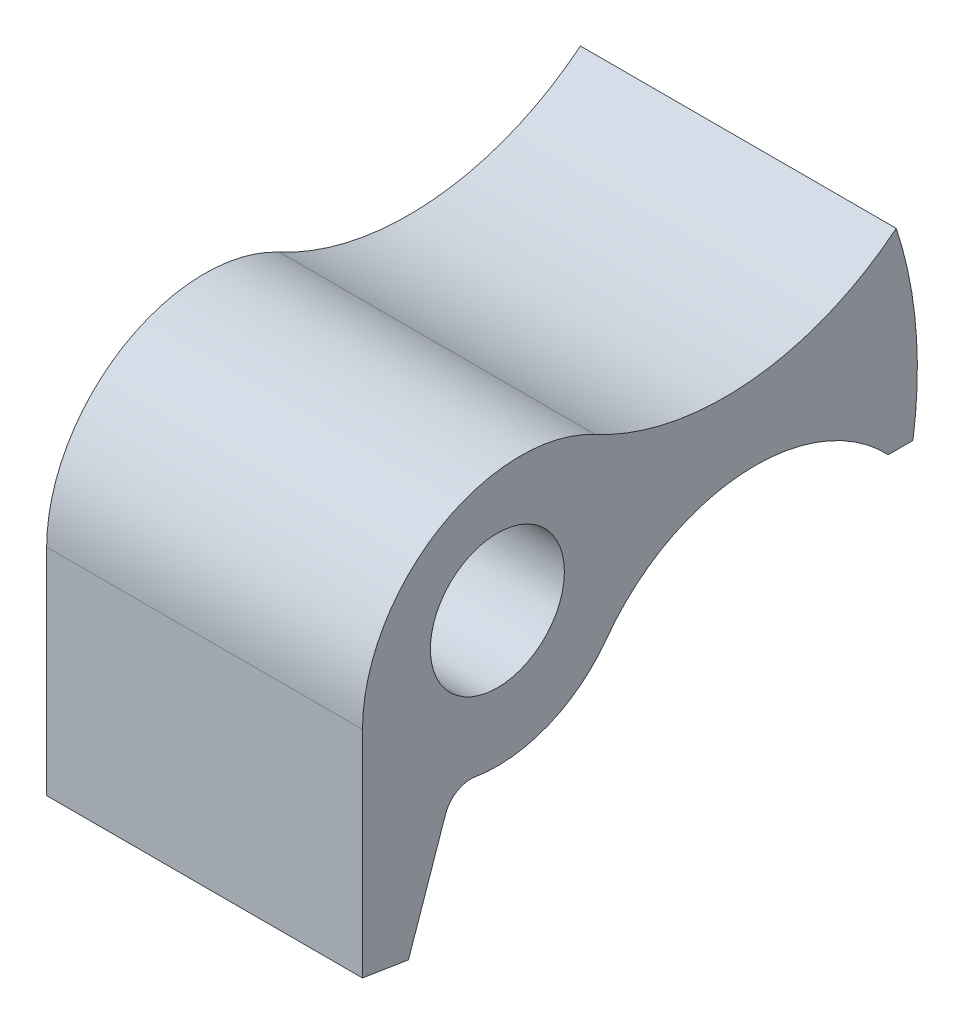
from build123d import *

# Parameters (mm, degrees)
SKETCH_1_R      = 1.9939
EXTRUDE_1_DEPTH = 4.699


with BuildPart() as part:
    # Sketch 1 → Extrude 1 (new, symmetric)
    with BuildSketch(Plane(origin=(0, 0, 0), x_dir=(0, 0, -1), z_dir=(1, 0, 0))):
        with BuildLine():
            Line((-4.0132, -1.059492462), (-4.0132, -7.465105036))
            Line((-4.0132, -7.465105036), (-2.645055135, -7.681797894))
            Line((-2.645055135, -7.681797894), (-1.543506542, -4.48266849))
            ThreePointArc((-1.543506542, -4.48266849), (-1.198866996, -4.058950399), (-0.662056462, -3.958213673))
            ThreePointArc((-0.662056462, -3.958213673), (1.521239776, -3.71370486), (3.248651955, -2.356275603))
            ThreePointArc((3.248651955, -2.356275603), (7.309852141, -0.113441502), (11.630464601, -1.8034))
            Line((11.630464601, -1.8034), (12.365992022, -1.8034))
            ThreePointArc((12.365992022, -1.8034), (12.449782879, 1.083012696), (11.868841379, 3.9116))
            ThreePointArc((11.868841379, 3.9116), (7.516321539, 2.143132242), (2.912308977, 3.07853349))
            ThreePointArc((2.912308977, 3.07853349), (-1.724411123, 2.974300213), (-4.0132, -1.059492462))
        make_face()
        Circle(SKETCH_1_R, mode=Mode.SUBTRACT)
    extrude(amount=EXTRUDE_1_DEPTH, both=True)

    # Sketch 2 → Cut-Revolve 1 (revolve, cut)
    with BuildSketch(Plane(origin=(0, 0, 0), x_dir=(0, 0, -1), z_dir=(1, 0, 0))):
        Polygon((7.970509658, 0.152009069), (9.990036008, -0.167852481), (9.806912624, -1.32404802), (7.787386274, -1.004186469), align=None)
    revolve(axis=Axis((0, -2.810086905, -7.501359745), (0, 0.9876883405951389, -0.156434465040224)), mode=Mode.SUBTRACT)


solid = part.part
